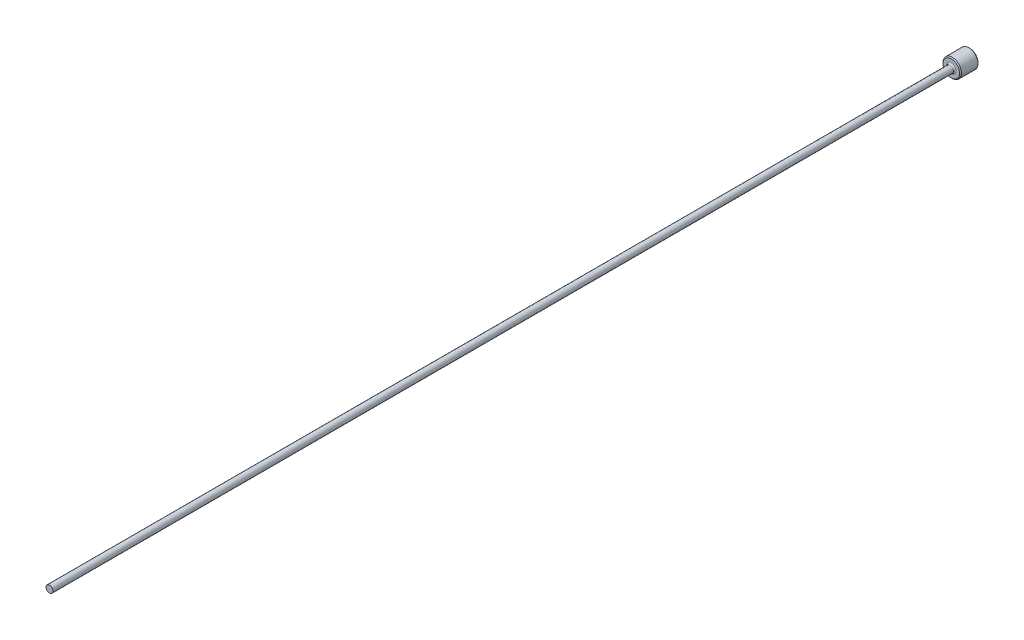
ISO-10303-21;
HEADER;
FILE_DESCRIPTION(('STEP AP214'),'2;1');
FILE_NAME('part.step','',(''),(''),'','','');
FILE_SCHEMA(('AUTOMOTIVE_DESIGN { 1 0 10303 214 1 1 1 1 }'));
ENDSEC;
DATA;
#1=APPLICATION_CONTEXT('core data for automotive mechanical design processes');
#2=APPLICATION_PROTOCOL_DEFINITION('international standard','automotive_design',2000,#1);
#3=PRODUCT_CONTEXT('',#1,'mechanical');
#4=PRODUCT('Part','Part','',(#3));
#5=PRODUCT_RELATED_PRODUCT_CATEGORY('part','',(#4));
#6=PRODUCT_DEFINITION_FORMATION('','',#4);
#7=PRODUCT_DEFINITION_CONTEXT('part definition',#1,'design');
#8=PRODUCT_DEFINITION('design','',#6,#7);
#9=PRODUCT_DEFINITION_SHAPE('','',#8);
#10=(LENGTH_UNIT() NAMED_UNIT(*) SI_UNIT(.MILLI.,.METRE.));
#11=(NAMED_UNIT(*) PLANE_ANGLE_UNIT() SI_UNIT($,.RADIAN.));
#12=(NAMED_UNIT(*) SI_UNIT($,.STERADIAN.) SOLID_ANGLE_UNIT());
#13=UNCERTAINTY_MEASURE_WITH_UNIT(LENGTH_MEASURE(1.E-05),#10,'distance_accuracy_value','');
#14=(GEOMETRIC_REPRESENTATION_CONTEXT(3) GLOBAL_UNCERTAINTY_ASSIGNED_CONTEXT((#13)) GLOBAL_UNIT_ASSIGNED_CONTEXT((#10,
#11,#12)) REPRESENTATION_CONTEXT('',''));
#15=CARTESIAN_POINT('',(0.,0.,0.));
#16=DIRECTION('',(0.,0.,1.));
#17=DIRECTION('',(1.,0.,0.));
#18=AXIS2_PLACEMENT_3D('',#15,#16,#17);
#19=CARTESIAN_POINT('',(0.,0.749999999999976,200.));
#20=DIRECTION('',(0.,0.,-1.));
#21=DIRECTION('',(-1.,0.,0.));
#22=AXIS2_PLACEMENT_3D('',#19,#20,#21);
#23=PLANE('',#22);
#24=CARTESIAN_POINT('',(0.,0.,200.));
#25=DIRECTION('',(0.,0.,1.));
#26=DIRECTION('',(1.,0.,0.));
#27=AXIS2_PLACEMENT_3D('',#24,#25,#26);
#28=CIRCLE('',#27,0.749999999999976);
#29=CARTESIAN_POINT('',(0.749999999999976,0.,200.));
#30=VERTEX_POINT('',#29);
#31=EDGE_CURVE('E50',#30,#30,#28,.T.);
#32=ORIENTED_EDGE('',*,*,#31,.T.);
#33=EDGE_LOOP('',(#32));
#34=FACE_BOUND('',#33,.T.);
#35=ADVANCED_FACE('F30',(#34),#23,.F.);
#36=CARTESIAN_POINT('',(0.,0.,109.050628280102));
#37=DIRECTION('',(0.,0.,1.));
#38=DIRECTION('',(1.,0.,0.));
#39=AXIS2_PLACEMENT_3D('',#36,#37,#38);
#40=CYLINDRICAL_SURFACE('',#39,0.749999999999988);
#41=ORIENTED_EDGE('',*,*,#31,.F.);
#42=EDGE_LOOP('',(#41));
#43=FACE_BOUND('',#42,.T.);
#44=CARTESIAN_POINT('',(0.,0.,4.3));
#45=DIRECTION('',(0.,0.,1.));
#46=DIRECTION('',(1.,0.,0.));
#47=AXIS2_PLACEMENT_3D('',#44,#45,#46);
#48=CIRCLE('',#47,0.75);
#49=CARTESIAN_POINT('',(0.75,0.,4.3));
#50=VERTEX_POINT('',#49);
#51=EDGE_CURVE('E53',#50,#50,#48,.T.);
#52=ORIENTED_EDGE('',*,*,#51,.T.);
#53=EDGE_LOOP('',(#52));
#54=FACE_BOUND('',#53,.T.);
#55=ADVANCED_FACE('F73',(#43,#54),#40,.T.);
#56=CARTESIAN_POINT('',(0.,0.,4.3));
#57=DIRECTION('',(0.,0.,1.));
#58=DIRECTION('',(1.,0.,0.));
#59=AXIS2_PLACEMENT_3D('',#56,#57,#58);
#60=TOROIDAL_SURFACE('',#59,1.05,0.3);
#61=ORIENTED_EDGE('',*,*,#51,.F.);
#62=EDGE_LOOP('',(#61));
#63=FACE_BOUND('',#62,.T.);
#64=CARTESIAN_POINT('',(0.,0.,4.));
#65=DIRECTION('',(0.,0.,1.));
#66=DIRECTION('',(1.,0.,0.));
#67=AXIS2_PLACEMENT_3D('',#64,#65,#66);
#68=CIRCLE('',#67,1.05);
#69=CARTESIAN_POINT('',(1.05,0.,4.));
#70=VERTEX_POINT('',#69);
#71=EDGE_CURVE('E56',#70,#70,#68,.T.);
#72=ORIENTED_EDGE('',*,*,#71,.T.);
#73=EDGE_LOOP('',(#72));
#74=FACE_BOUND('',#73,.T.);
#75=ADVANCED_FACE('F60',(#63,#74),#60,.F.);
#76=CARTESIAN_POINT('',(0.,2.,4.));
#77=DIRECTION('',(0.,0.,-1.));
#78=DIRECTION('',(-1.,0.,0.));
#79=AXIS2_PLACEMENT_3D('',#76,#77,#78);
#80=PLANE('',#79);
#81=CARTESIAN_POINT('',(0.,0.,4.));
#82=DIRECTION('',(0.,0.,-1.));
#83=DIRECTION('',(-1.,0.,0.));
#84=AXIS2_PLACEMENT_3D('',#81,#82,#83);
#85=CIRCLE('',#84,1.79999999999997);
#86=CARTESIAN_POINT('',(-1.79999999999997,0.,4.));
#87=VERTEX_POINT('',#86);
#88=EDGE_CURVE('E10',#87,#87,#85,.F.);
#89=ORIENTED_EDGE('',*,*,#88,.T.);
#90=EDGE_LOOP('',(#89));
#91=FACE_BOUND('',#90,.T.);
#92=ORIENTED_EDGE('',*,*,#71,.F.);
#93=EDGE_LOOP('',(#92));
#94=FACE_BOUND('',#93,.T.);
#95=ADVANCED_FACE('F62',(#91,#94),#80,.F.);
#96=CARTESIAN_POINT('',(0.,0.,109.050628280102));
#97=DIRECTION('',(0.,0.,1.));
#98=DIRECTION('',(1.,0.,0.));
#99=AXIS2_PLACEMENT_3D('',#96,#97,#98);
#100=CYLINDRICAL_SURFACE('',#99,2.);
#101=CARTESIAN_POINT('',(0.,0.,0.199999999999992));
#102=DIRECTION('',(0.,0.,1.));
#103=DIRECTION('',(1.,0.,0.));
#104=AXIS2_PLACEMENT_3D('',#101,#102,#103);
#105=CIRCLE('',#104,2.);
#106=CARTESIAN_POINT('',(2.,0.,0.199999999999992));
#107=VERTEX_POINT('',#106);
#108=EDGE_CURVE('E41',#107,#107,#105,.T.);
#109=ORIENTED_EDGE('',*,*,#108,.T.);
#110=EDGE_LOOP('',(#109));
#111=FACE_BOUND('',#110,.T.);
#112=CARTESIAN_POINT('',(0.,0.,3.79999999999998));
#113=DIRECTION('',(0.,0.,-1.));
#114=DIRECTION('',(-1.,0.,0.));
#115=AXIS2_PLACEMENT_3D('',#112,#113,#114);
#116=CIRCLE('',#115,2.);
#117=CARTESIAN_POINT('',(-2.,0.,3.79999999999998));
#118=VERTEX_POINT('',#117);
#119=EDGE_CURVE('E45',#118,#118,#116,.T.);
#120=ORIENTED_EDGE('',*,*,#119,.T.);
#121=EDGE_LOOP('',(#120));
#122=FACE_BOUND('',#121,.T.);
#123=ADVANCED_FACE('F64',(#111,#122),#100,.T.);
#124=CARTESIAN_POINT('',(0.,0.,0.));
#125=DIRECTION('',(0.,0.,1.));
#126=DIRECTION('',(1.,0.,0.));
#127=AXIS2_PLACEMENT_3D('',#124,#125,#126);
#128=PLANE('',#127);
#129=CARTESIAN_POINT('',(0.,0.,0.));
#130=DIRECTION('',(0.,0.,1.));
#131=DIRECTION('',(1.,0.,0.));
#132=AXIS2_PLACEMENT_3D('',#129,#130,#131);
#133=CIRCLE('',#132,1.79999999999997);
#134=CARTESIAN_POINT('',(1.79999999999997,0.,0.));
#135=VERTEX_POINT('',#134);
#136=EDGE_CURVE('E37',#135,#135,#133,.F.);
#137=ORIENTED_EDGE('',*,*,#136,.T.);
#138=EDGE_LOOP('',(#137));
#139=FACE_BOUND('',#138,.T.);
#140=ADVANCED_FACE('F70',(#139),#128,.F.);
#141=CARTESIAN_POINT('',(0.,0.,0.199999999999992));
#142=DIRECTION('',(0.,0.,1.));
#143=DIRECTION('',(1.,0.,0.));
#144=AXIS2_PLACEMENT_3D('',#141,#142,#143);
#145=CONICAL_SURFACE('',#144,2.,0.785398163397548);
#146=ORIENTED_EDGE('',*,*,#136,.F.);
#147=EDGE_LOOP('',(#146));
#148=FACE_BOUND('',#147,.T.);
#149=ORIENTED_EDGE('',*,*,#108,.F.);
#150=EDGE_LOOP('',(#149));
#151=FACE_BOUND('',#150,.T.);
#152=ADVANCED_FACE('F84',(#148,#151),#145,.T.);
#153=CARTESIAN_POINT('',(0.,0.,4.));
#154=DIRECTION('',(0.,0.,-1.));
#155=DIRECTION('',(-1.,0.,0.));
#156=AXIS2_PLACEMENT_3D('',#153,#154,#155);
#157=CONICAL_SURFACE('',#156,1.79999999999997,0.785398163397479);
#158=ORIENTED_EDGE('',*,*,#119,.F.);
#159=EDGE_LOOP('',(#158));
#160=FACE_BOUND('',#159,.T.);
#161=ORIENTED_EDGE('',*,*,#88,.F.);
#162=EDGE_LOOP('',(#161));
#163=FACE_BOUND('',#162,.T.);
#164=ADVANCED_FACE('F32',(#160,#163),#157,.T.);
#165=CLOSED_SHELL('',(#35,#55,#75,#95,#123,#140,#152,#164));
#166=MANIFOLD_SOLID_BREP('B2',#165);
#167=ADVANCED_BREP_SHAPE_REPRESENTATION('',(#18,#166),#14);
#168=SHAPE_DEFINITION_REPRESENTATION(#9,#167);
ENDSEC;
END-ISO-10303-21;
